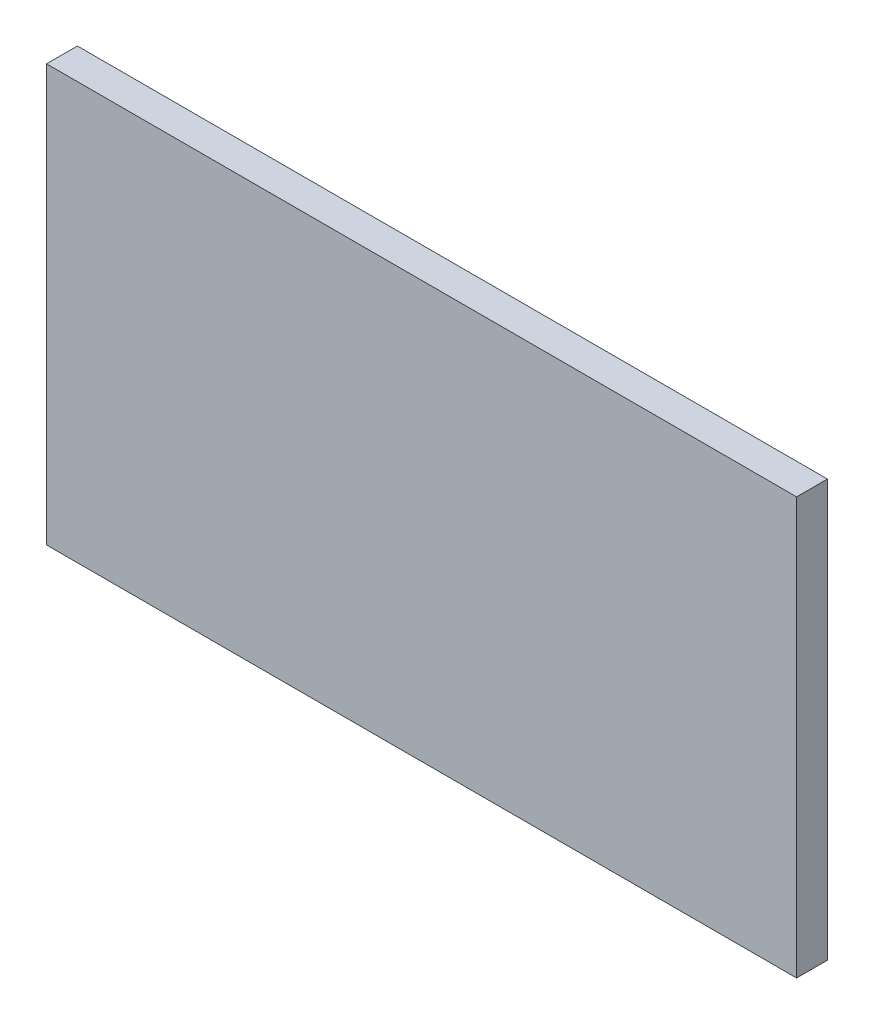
from build123d import *

# Parameters (mm, degrees)
SKETCH_1_W      = 900
SKETCH_1_H      = 500
EXTRUDE_1_DEPTH = 37


with BuildPart() as part:
    # Sketch 1 → Extrude 1 (new body)
    with BuildSketch(Plane.XY):
        with Locations((-450, -1764.136753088)):
            Rectangle(SKETCH_1_W, SKETCH_1_H)
    extrude(amount=EXTRUDE_1_DEPTH)


solid = part.part
